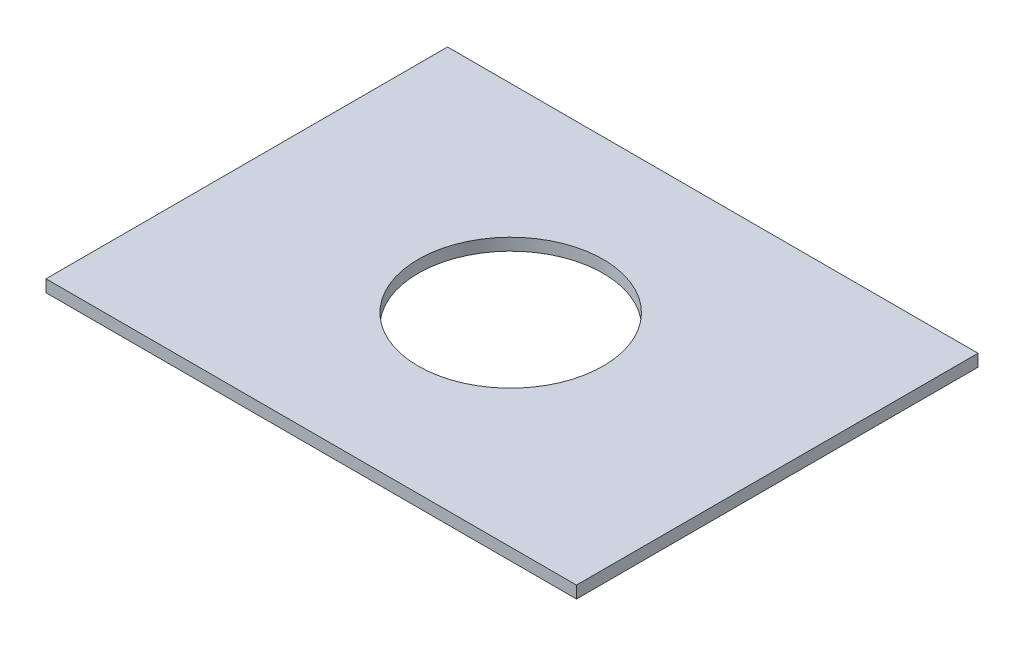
from build123d import *

# Parameters (mm, degrees)
SKETCH1_W          = 111.357497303
SKETCH1_H          = 84.286105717
EXTRUDE1_DEPTH     = 2.54
SKETCH2_R          = 19.413247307
CUT_EXTRUDE1_DEPTH = 140.682108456


with BuildPart() as part:
    # Sketch1 → Extrude1 (new body)
    with BuildSketch(Plane(origin=(0, 0, 0), x_dir=(1, 0, 0), z_dir=(0, 1, 0))):
        with Locations((55.678748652, 42.143052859)):
            Rectangle(SKETCH1_W, SKETCH1_H)
    extrude(amount=EXTRUDE1_DEPTH)

    # Sketch2 → Cut-Extrude1 (cut, through all)
    with BuildSketch(Plane(origin=(0, 2.54, 0), x_dir=(-1, 0, 0), z_dir=(0, 1, 0))):
        with Locations(Location((-54.936146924, -42.607178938, 0), (0, 0, 90))):
            Circle(SKETCH2_R)
    extrude(amount=-CUT_EXTRUDE1_DEPTH, mode=Mode.SUBTRACT)


solid = part.part
